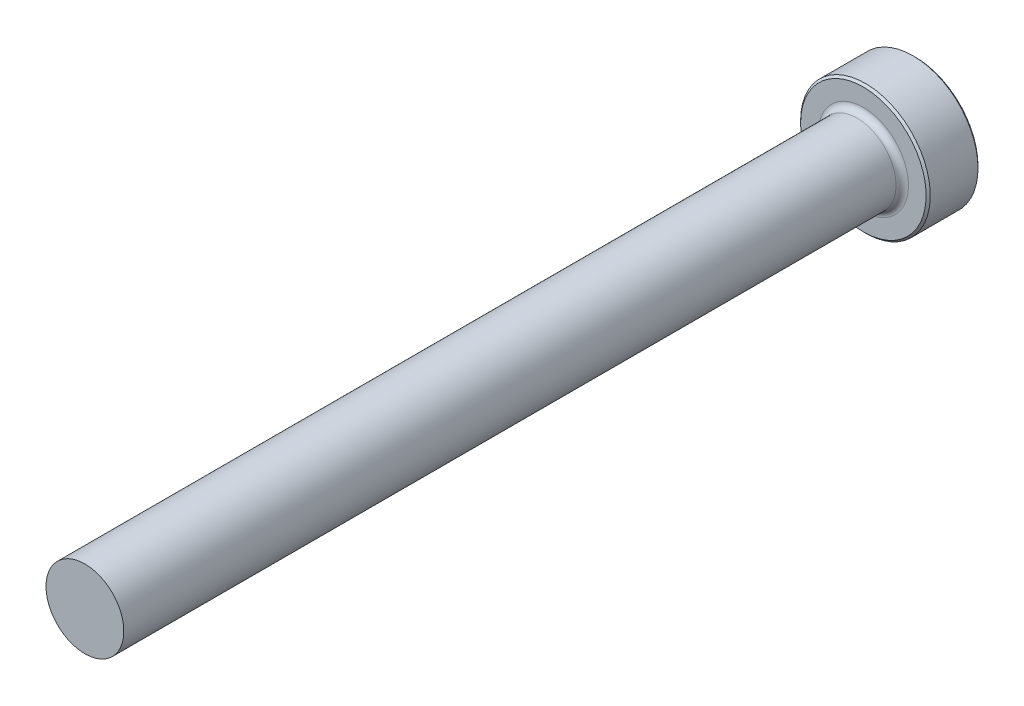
from build123d import *

# Parameters (mm, degrees)
CHAMFER1_SIZE = 0.254


with BuildPart() as part:
    # Sketch2 → Revolve1 (revolve)
    with BuildSketch(Plane(origin=(0, 0, 0), x_dir=(0, 0, 1), z_dir=(1, 0, 0)), mode=Mode.PRIVATE) as revolve1_sk:
        with BuildLine():
            Line((101.6254, 0), (0, 0))
            Line((0, 0), (0, 7.9375))
            Line((0, 7.9375), (6.35, 7.9375))
            Line((6.35, 7.9375), (6.35, 5.5245))
            ThreePointArc((6.35, 5.5245), (6.573184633, 4.985684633), (7.112, 4.7625))
            Line((7.112, 4.7625), (101.6254, 4.7625))
            Line((101.6254, 4.7625), (101.6254, 0))
        make_face()
    revolve(revolve1_sk.sketch.rotate(Axis((0, 0, -2.147539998), (0, 0, 1)), 270), axis=Axis((0, 0, -2.147539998), (0, 0, 1)))

    # Chamfer1
    chamfer1_edges = [part.edges().sort_by_distance(p)[0] for p in [
        (7.9375, 0, 6.35),
        (7.9375, 0, 0),
    ]]
    chamfer(chamfer1_edges, length=CHAMFER1_SIZE)


solid = part.part
